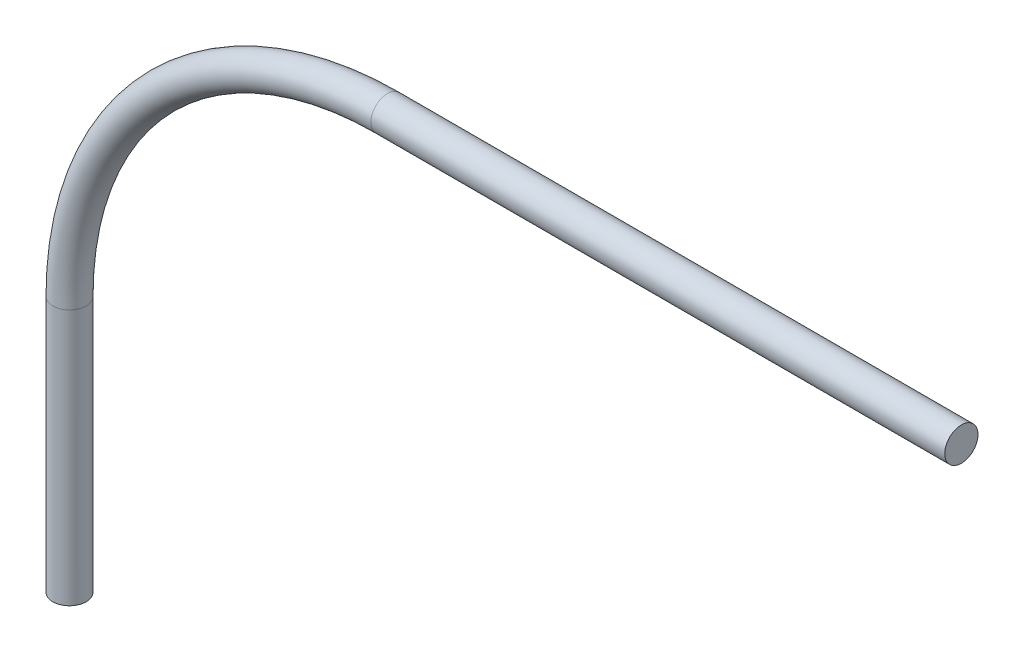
ISO-10303-21;
HEADER;
FILE_DESCRIPTION(('STEP AP214'),'2;1');
FILE_NAME('part.step','',(''),(''),'','','');
FILE_SCHEMA(('AUTOMOTIVE_DESIGN { 1 0 10303 214 1 1 1 1 }'));
ENDSEC;
DATA;
#1=APPLICATION_CONTEXT('core data for automotive mechanical design processes');
#2=APPLICATION_PROTOCOL_DEFINITION('international standard','automotive_design',2000,#1);
#3=PRODUCT_CONTEXT('',#1,'mechanical');
#4=PRODUCT('Part','Part','',(#3));
#5=PRODUCT_RELATED_PRODUCT_CATEGORY('part','',(#4));
#6=PRODUCT_DEFINITION_FORMATION('','',#4);
#7=PRODUCT_DEFINITION_CONTEXT('part definition',#1,'design');
#8=PRODUCT_DEFINITION('design','',#6,#7);
#9=PRODUCT_DEFINITION_SHAPE('','',#8);
#10=(LENGTH_UNIT() NAMED_UNIT(*) SI_UNIT(.MILLI.,.METRE.));
#11=(NAMED_UNIT(*) PLANE_ANGLE_UNIT() SI_UNIT($,.RADIAN.));
#12=(NAMED_UNIT(*) SI_UNIT($,.STERADIAN.) SOLID_ANGLE_UNIT());
#13=UNCERTAINTY_MEASURE_WITH_UNIT(LENGTH_MEASURE(1.E-05),#10,'distance_accuracy_value','');
#14=(GEOMETRIC_REPRESENTATION_CONTEXT(3) GLOBAL_UNCERTAINTY_ASSIGNED_CONTEXT((#13)) GLOBAL_UNIT_ASSIGNED_CONTEXT((#10,
#11,#12)) REPRESENTATION_CONTEXT('',''));
#15=CARTESIAN_POINT('',(0.,0.,0.));
#16=DIRECTION('',(0.,0.,1.));
#17=DIRECTION('',(1.,0.,0.));
#18=AXIS2_PLACEMENT_3D('',#15,#16,#17);
#19=CARTESIAN_POINT('',(15.659275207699,169.578380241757,0.));
#20=DIRECTION('',(1.,0.,0.));
#21=DIRECTION('',(0.,0.,-1.));
#22=AXIS2_PLACEMENT_3D('',#19,#20,#21);
#23=CYLINDRICAL_SURFACE('',#22,3.80999999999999);
#24=CARTESIAN_POINT('',(15.659275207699,169.578380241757,0.));
#25=DIRECTION('',(1.,0.,0.));
#26=DIRECTION('',(0.,0.,1.));
#27=AXIS2_PLACEMENT_3D('',#24,#25,#26);
#28=CIRCLE('',#27,3.80999999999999);
#29=CARTESIAN_POINT('',(15.659275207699,173.388380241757,0.));
#30=VERTEX_POINT('',#29);
#31=EDGE_CURVE('E35',#30,#30,#28,.T.);
#32=ORIENTED_EDGE('',*,*,#31,.T.);
#33=EDGE_LOOP('',(#32));
#34=FACE_BOUND('',#33,.T.);
#35=CARTESIAN_POINT('',(147.058088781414,169.578380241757,0.));
#36=DIRECTION('',(1.,0.,0.));
#37=DIRECTION('',(0.,0.,1.));
#38=AXIS2_PLACEMENT_3D('',#35,#36,#37);
#39=CIRCLE('',#38,3.80999999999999);
#40=CARTESIAN_POINT('',(147.058088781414,169.578380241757,3.80999999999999));
#41=VERTEX_POINT('',#40);
#42=EDGE_CURVE('E10',#41,#41,#39,.T.);
#43=ORIENTED_EDGE('',*,*,#42,.F.);
#44=EDGE_LOOP('',(#43));
#45=FACE_BOUND('',#44,.T.);
#46=ADVANCED_FACE('F29',(#34,#45),#23,.T.);
#47=CARTESIAN_POINT('',(15.659275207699,96.7691050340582,0.));
#48=DIRECTION('',(0.,0.,-1.));
#49=DIRECTION('',(-1.,0.,0.));
#50=AXIS2_PLACEMENT_3D('',#47,#48,#49);
#51=TOROIDAL_SURFACE('',#50,72.8092752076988,3.80999999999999);
#52=CARTESIAN_POINT('',(-57.1499999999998,96.7691050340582,0.));
#53=DIRECTION('',(0.,1.,0.));
#54=DIRECTION('',(0.,0.,1.));
#55=AXIS2_PLACEMENT_3D('',#52,#53,#54);
#56=CIRCLE('',#55,3.80999999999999);
#57=CARTESIAN_POINT('',(-60.9599999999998,96.7691050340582,0.));
#58=VERTEX_POINT('',#57);
#59=EDGE_CURVE('E39',#58,#58,#56,.T.);
#60=CARTESIAN_POINT('',(15.659275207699,96.7691050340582,0.));
#61=DIRECTION('',(0.,0.,-1.));
#62=DIRECTION('',(-1.,0.,0.));
#63=AXIS2_PLACEMENT_3D('',#60,#61,#62);
#64=CIRCLE('',#63,76.6192752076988);
#65=EDGE_CURVE('',#58,#30,#64,.T.);
#66=ORIENTED_EDGE('',*,*,#59,.T.);
#67=ORIENTED_EDGE('',*,*,#31,.F.);
#68=ORIENTED_EDGE('',*,*,#65,.T.);
#69=ORIENTED_EDGE('',*,*,#65,.F.);
#70=EDGE_LOOP('',(#66,#68,#67,#69));
#71=FACE_BOUND('',#70,.T.);
#72=ADVANCED_FACE('F61',(#71),#51,.T.);
#73=CARTESIAN_POINT('',(-57.1499999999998,96.7691050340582,0.));
#74=DIRECTION('',(0.,-1.,0.));
#75=DIRECTION('',(0.,0.,-1.));
#76=AXIS2_PLACEMENT_3D('',#73,#74,#75);
#77=CYLINDRICAL_SURFACE('',#76,3.80999999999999);
#78=ORIENTED_EDGE('',*,*,#59,.F.);
#79=EDGE_LOOP('',(#78));
#80=FACE_BOUND('',#79,.T.);
#81=CARTESIAN_POINT('',(-57.1499999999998,38.1,0.));
#82=DIRECTION('',(0.,1.,0.));
#83=DIRECTION('',(0.,0.,1.));
#84=AXIS2_PLACEMENT_3D('',#81,#82,#83);
#85=CIRCLE('',#84,3.80999999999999);
#86=CARTESIAN_POINT('',(-57.1499999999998,38.1,3.80999999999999));
#87=VERTEX_POINT('',#86);
#88=EDGE_CURVE('E43',#87,#87,#85,.T.);
#89=ORIENTED_EDGE('',*,*,#88,.T.);
#90=EDGE_LOOP('',(#89));
#91=FACE_BOUND('',#90,.T.);
#92=ADVANCED_FACE('F49',(#80,#91),#77,.T.);
#93=CARTESIAN_POINT('',(147.058088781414,169.578380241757,0.));
#94=DIRECTION('',(1.,0.,0.));
#95=DIRECTION('',(0.,0.,1.));
#96=AXIS2_PLACEMENT_3D('',#93,#94,#95);
#97=PLANE('',#96);
#98=ORIENTED_EDGE('',*,*,#42,.T.);
#99=EDGE_LOOP('',(#98));
#100=FACE_BOUND('',#99,.T.);
#101=ADVANCED_FACE('F53',(#100),#97,.T.);
#102=CARTESIAN_POINT('',(-57.1499999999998,38.1,0.));
#103=DIRECTION('',(0.,1.,0.));
#104=DIRECTION('',(0.,0.,1.));
#105=AXIS2_PLACEMENT_3D('',#102,#103,#104);
#106=PLANE('',#105);
#107=ORIENTED_EDGE('',*,*,#88,.F.);
#108=EDGE_LOOP('',(#107));
#109=FACE_BOUND('',#108,.T.);
#110=ADVANCED_FACE('F51',(#109),#106,.F.);
#111=CLOSED_SHELL('',(#46,#72,#92,#101,#110));
#112=MANIFOLD_SOLID_BREP('B2',#111);
#113=ADVANCED_BREP_SHAPE_REPRESENTATION('',(#18,#112),#14);
#114=SHAPE_DEFINITION_REPRESENTATION(#9,#113);
ENDSEC;
END-ISO-10303-21;
